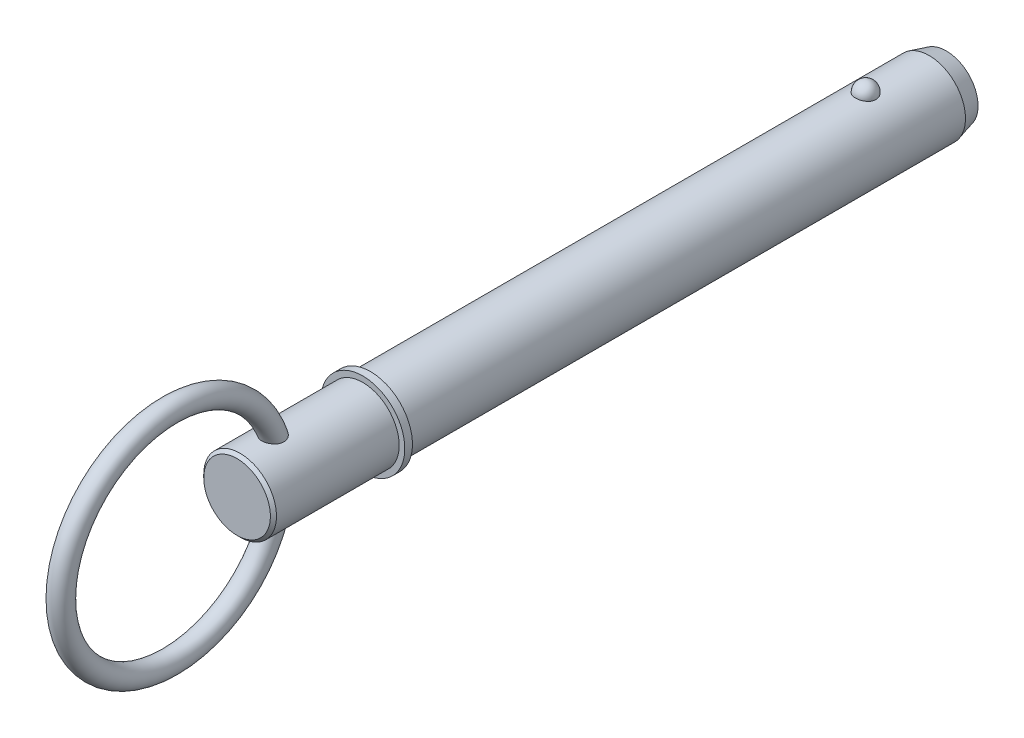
from build123d import *

# Parameters (mm, degrees)
SKETCH2_R           = 9.525
BOSS_EXTRUDE1_DEPTH = 127
BOSS_EXTRUDE2_START = 23.8
SKETCH3_R           = 9.525
BOSS_EXTRUDE2_DEPTH = 23.8
CHAMFER1_SIZE       = 4.5
CHAMFER1_SIZE2      = 1.205771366
SKETCH20_W          = 2
SKETCH20_H          = 11
SKETCH21_R          = 9.525
BOSS_EXTRUDE3_DEPTH = 34.93
CHAMFER2_SIZE       = 0.8
SKETCH24_R          = 2.75


with BuildPart() as part:
    # Sketch2 → Boss-Extrude1 (new body)
    with BuildSketch(Plane.XY):
        Circle(SKETCH2_R)
    extrude(amount=BOSS_EXTRUDE1_DEPTH)

    # Sketch3 → Boss-Extrude2 (add)
    with BuildSketch(Plane(origin=(0, 0, 0), x_dir=(-1, 0, 0), z_dir=(0, 0, -1)).offset(BOSS_EXTRUDE2_START)):
        Circle(SKETCH3_R)
    extrude(amount=-BOSS_EXTRUDE2_DEPTH)

    # Chamfer1
    chamfer1_edges = [part.edges().sort_by_distance(p)[0] for p in [
        (9.525, 0, -23.8),
    ]]
    chamfer1_side = [part.faces().sort_by_distance(p)[0] for p in [
        (9.525, 0, -11.9),
    ]]
    chamfer(chamfer1_edges, length=CHAMFER1_SIZE, length2=CHAMFER1_SIZE2, reference=chamfer1_side[0])

    # Sketch18 → Revolve1 (revolve)
    with BuildSketch(Plane(origin=(0, 0, 0), x_dir=(0, 0, -1), z_dir=(1, 0, 0))):
        with BuildLine():
            Line((2.69, 12.215), (2.69, 6.835))
            ThreePointArc((2.69, 6.835), (0, 9.525), (2.69, 12.215))
        make_face()
    revolve(axis=Axis((0, 12.215, -2.69), (0, -1, 0)))

    # Sketch20 → Revolve2 (revolve)
    with BuildSketch(Plane(origin=(0, 0, 0), x_dir=(0, 0, -1), z_dir=(1, 0, 0)), mode=Mode.PRIVATE) as revolve2_sk:
        with Locations((-128, 5.5)):
            Rectangle(SKETCH20_W, SKETCH20_H)
    revolve(revolve2_sk.sketch.rotate(Axis((0, 0, 33.728787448), (0, 0, 1)), 90), axis=Axis((0, 0, 33.728787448), (0, 0, 1)))

    # Sketch21 → Boss-Extrude3 (add)
    with BuildSketch(Plane(origin=(0, 0, 127), x_dir=(-1, 0, 0), z_dir=(0, 0, -1))):
        Circle(SKETCH21_R)
    extrude(amount=-BOSS_EXTRUDE3_DEPTH)

    # Chamfer2
    chamfer2_edges = [part.edges().sort_by_distance(p)[0] for p in [
        (9.525, 0, 161.93),
    ]]
    chamfer(chamfer2_edges, length=CHAMFER2_SIZE)

    # Sweep1: sweep along a path in Sketch23
    with BuildLine(Plane(origin=(0, 0, 0), x_dir=(0, 0, -1), z_dir=(1, 0, 0))) as sweep1_path:
        CenterArc((-179.505, 0), 28.575, 0, 360)
    # Sketch24 → Sweep1 (sweep)
    with BuildSketch(Plane(origin=(0, 0, 0), x_dir=(1, 0, 0), z_dir=(0, 1, 0))):
        with Locations((0, -150.93)):
            Circle(SKETCH24_R)
    sweep(path=sweep1_path.line)


solid = part.part
